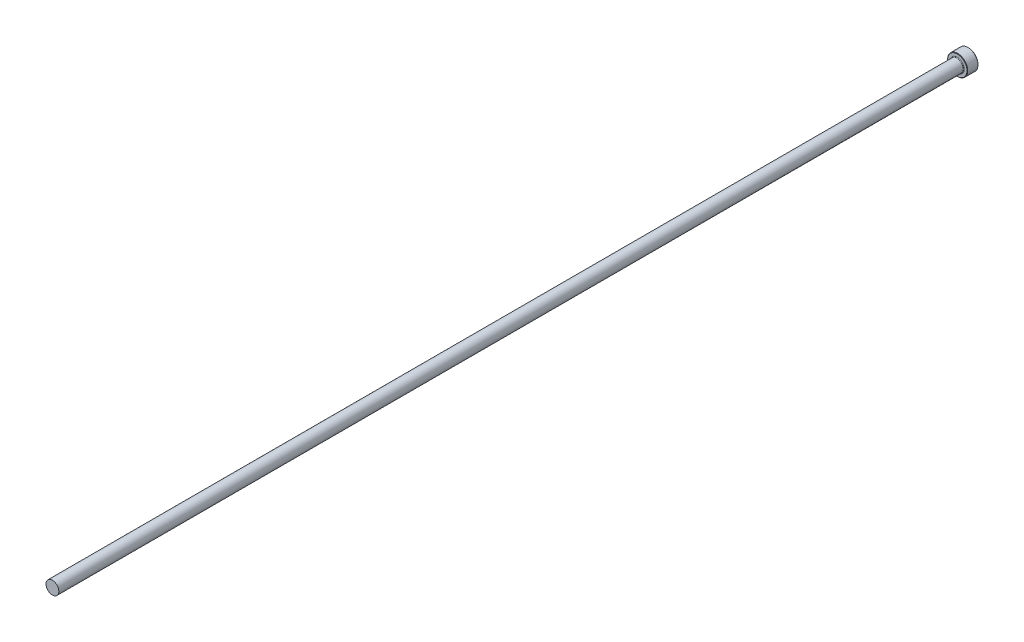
from build123d import *

# Parameters (mm, degrees)
CHAMFER1_SIZE = 0.2


with BuildPart() as part:
    # Sketch1 → Revolve1 (revolve)
    with BuildSketch(Plane(origin=(0, 0, 0), x_dir=(0, 0, -1), z_dir=(1, 0, 0)), mode=Mode.PRIVATE) as revolve1_sk:
        with BuildLine():
            Line((0, 0), (0, 5.5))
            Line((0, 5.5), (-6, 5.5))
            Line((-6, 5.5), (-6, 3.8))
            ThreePointArc((-6, 3.8), (-6.087867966, 3.587867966), (-6.3, 3.5))
            Line((-6.3, 3.5), (-500, 3.5))
            Line((-500, 3.5), (-500, 0))
            Line((-500, 0), (0, 0))
        make_face()
    revolve(revolve1_sk.sketch.rotate(Axis((0, 0, 109.05062828), (0, 0, -1)), 90), axis=Axis((0, 0, 109.05062828), (0, 0, -1)))

    # Chamfer1
    chamfer1_edges = [part.edges().sort_by_distance(p)[0] for p in [
        (-5.5, 0, 0),
        (-5.5, 0, 6),
    ]]
    chamfer(chamfer1_edges, length=CHAMFER1_SIZE)


solid = part.part
